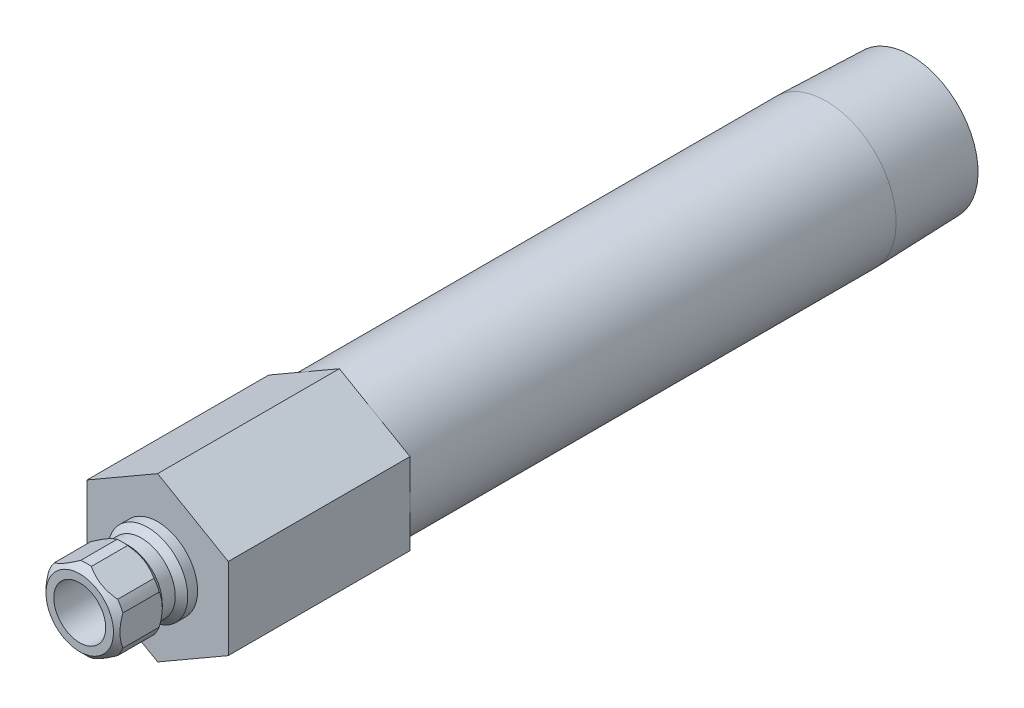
from build123d import *

# Parameters (mm, degrees)
SKETCH2_R           = 3.175
BOSS_EXTRUDE1_DEPTH = 22.225
CUT_EXTRUDE1_START  = 3.556
SKETCH3_OUTSIDE_W   = 40.266
SKETCH3_OUTSIDE_H   = 42.938
CUT_EXTRUDE1_DEPTH  = 90.459196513


with BuildPart() as part:
    # Sketch1 → Revolve1 (revolve)
    with BuildSketch(Plane(origin=(0, 0, 0), x_dir=(0, 0, -1), z_dir=(1, 0, 0))):
        Polygon((-9.525, 3.175), (-9.525, 4.1275), (-8.763, 4.8895), (-4.318, 4.8895), (-3.556, 4.1275), (-1.9685, 4.1275), (-1.2065, 4.8895), (0, 4.8895), (0, 8.5725), (81.7372, 8.5725), (92.075, 8.249445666), (92.075, 6.2611), (22.225, 6.2611), (22.225, 3.175), align=None)
    revolve(axis=Axis((0, 0, 0), (0, 0, 1)))

    # Sketch2 → Boss-Extrude1 (add)
    with BuildSketch(Plane.XY):
        Polygon((-8.636, 4.985996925), (-8.636, -4.985996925), (0, -9.971993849), (8.636, -4.985996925), (8.636, 4.985996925), (0, 9.971993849), align=None)
        with Locations(Location((0, 0, 0), (0, 0, 90))):
            Circle(SKETCH2_R, mode=Mode.SUBTRACT)
    extrude(amount=-BOSS_EXTRUDE1_DEPTH)

    # Sketch3 outside → Cut-Extrude1 (cut, through all)
    with BuildSketch(Plane.XY.offset(CUT_EXTRUDE1_START)):
        Rectangle(SKETCH3_OUTSIDE_W, SKETCH3_OUTSIDE_H)
        Polygon((4.5212, 2.610316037), (0, 5.220632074), (-4.5212, 2.610316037), (-4.5212, -2.610316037), (0, -5.220632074), (4.5212, -2.610316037), align=None, mode=Mode.SUBTRACT)
    extrude(amount=CUT_EXTRUDE1_DEPTH, mode=Mode.SUBTRACT)


solid = part.part
